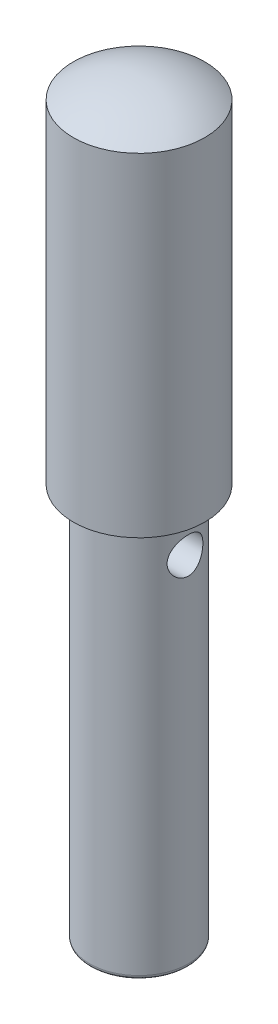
from build123d import *

# Parameters (mm, degrees)
SKETCH2_R          = 3.9878
CUT_EXTRUDE1_DEPTH = 7.9375
TAP_3125_241_D     = 6.9088
TAP_3125_241_DEPTH = 12.7
TAP_3125_241_TIP   = 2.075612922


with BuildPart() as part:
    # Sketch1 → Base-Revolve (revolve)
    with BuildSketch(Plane.XY, mode=Mode.PRIVATE) as base_revolve_sk:
        with BuildLine():
            Line((-8.71982, 0), (0, 0))
            Line((0, 0), (0, 144.4625))
            ThreePointArc((0, 144.4625), (-6.651526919, 143.439772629), (-12.68857, 140.466072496))
            Line((-12.68857, 140.466072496), (-12.68857, 76.2))
            Line((-12.68857, 76.2), (-10.02157, 76.2))
            ThreePointArc((-10.02157, 76.2), (-9.662359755, 76.051210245), (-9.51357, 75.692))
            Line((-9.51357, 75.692), (-9.51357, 0.79375))
            ThreePointArc((-9.51357, 0.79375), (-9.281086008, 0.232483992), (-8.71982, 0))
        make_face()
    revolve(base_revolve_sk.sketch.rotate(Axis((0, 0, 0), (0, 1, 0)), 180), axis=Axis((0, 0, 0), (0, 1, 0)))

    # Sketch2 → Cut-Extrude1 (cut)
    with BuildSketch(Plane(origin=(-9.51357, 0, 0), x_dir=(0, 0, -1), z_dir=(1, 0, 0))):
        with Locations(Location((0, 69.05625, 0), (0, 0, 180))):
            Circle(SKETCH2_R)
    extrude(amount=CUT_EXTRUDE1_DEPTH, mode=Mode.SUBTRACT)

    # TAP.3125-241
    with Locations(Plane(origin=(-1.57607, 99.818498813, -5.138205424), x_dir=(0, 0, 1), z_dir=(-1, 0, 0))):
        with Locations((5.138205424, -30.762248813)):
            Hole(TAP_3125_241_D / 2, depth=TAP_3125_241_DEPTH)
            with Locations((0, 0, -(TAP_3125_241_DEPTH + TAP_3125_241_TIP / 2))):  # 118° drill point
                Cone(0, TAP_3125_241_D / 2, TAP_3125_241_TIP, mode=Mode.SUBTRACT)


solid = part.part
